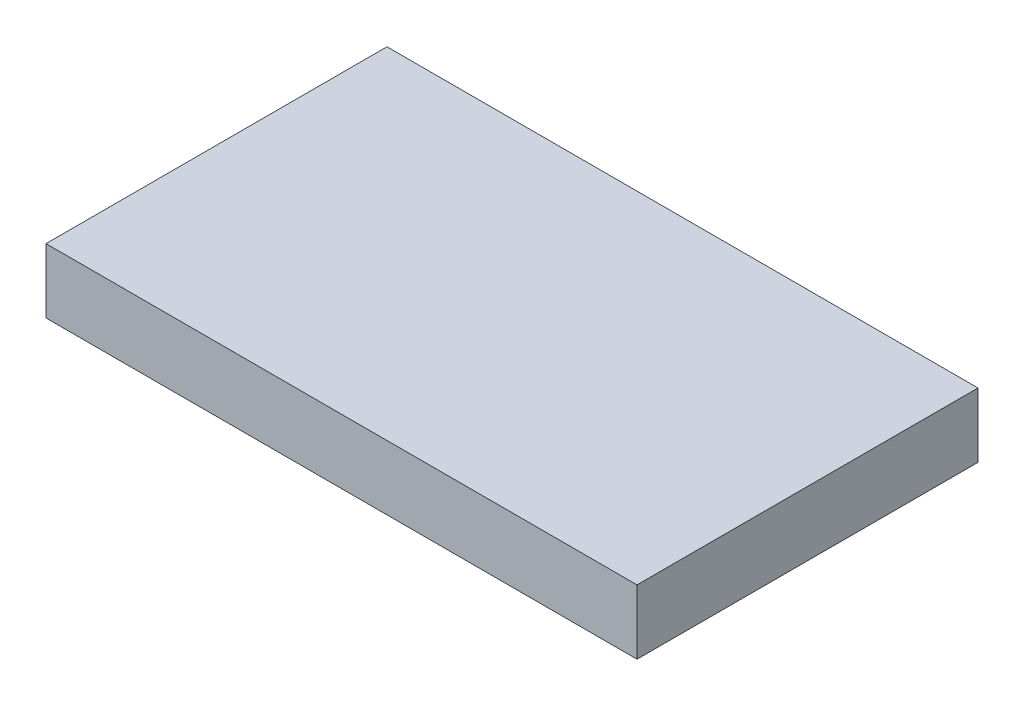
ISO-10303-21;
HEADER;
FILE_DESCRIPTION(('STEP AP214'),'2;1');
FILE_NAME('part.step','',(''),(''),'','','');
FILE_SCHEMA(('AUTOMOTIVE_DESIGN { 1 0 10303 214 1 1 1 1 }'));
ENDSEC;
DATA;
#1=APPLICATION_CONTEXT('core data for automotive mechanical design processes');
#2=APPLICATION_PROTOCOL_DEFINITION('international standard','automotive_design',2000,#1);
#3=PRODUCT_CONTEXT('',#1,'mechanical');
#4=PRODUCT('Part','Part','',(#3));
#5=PRODUCT_RELATED_PRODUCT_CATEGORY('part','',(#4));
#6=PRODUCT_DEFINITION_FORMATION('','',#4);
#7=PRODUCT_DEFINITION_CONTEXT('part definition',#1,'design');
#8=PRODUCT_DEFINITION('design','',#6,#7);
#9=PRODUCT_DEFINITION_SHAPE('','',#8);
#10=(LENGTH_UNIT() NAMED_UNIT(*) SI_UNIT(.MILLI.,.METRE.));
#11=(NAMED_UNIT(*) PLANE_ANGLE_UNIT() SI_UNIT($,.RADIAN.));
#12=(NAMED_UNIT(*) SI_UNIT($,.STERADIAN.) SOLID_ANGLE_UNIT());
#13=UNCERTAINTY_MEASURE_WITH_UNIT(LENGTH_MEASURE(1.E-05),#10,'distance_accuracy_value','');
#14=(GEOMETRIC_REPRESENTATION_CONTEXT(3) GLOBAL_UNCERTAINTY_ASSIGNED_CONTEXT((#13)) GLOBAL_UNIT_ASSIGNED_CONTEXT((#10,
#11,#12)) REPRESENTATION_CONTEXT('',''));
#15=CARTESIAN_POINT('',(0.,0.,0.));
#16=DIRECTION('',(0.,0.,1.));
#17=DIRECTION('',(1.,0.,0.));
#18=AXIS2_PLACEMENT_3D('',#15,#16,#17);
#19=CARTESIAN_POINT('',(78.,17.,45.));
#20=DIRECTION('',(-1.,0.,0.));
#21=DIRECTION('',(0.,0.,1.));
#22=AXIS2_PLACEMENT_3D('',#19,#20,#21);
#23=PLANE('',#22);
#24=DIRECTION('',(0.,0.,-1.));
#25=VECTOR('',#24,1.);
#26=CARTESIAN_POINT('',(78.,0.,45.));
#27=LINE('',#26,#25);
#28=CARTESIAN_POINT('',(78.,0.,45.));
#29=VERTEX_POINT('',#28);
#30=CARTESIAN_POINT('',(78.,0.,-45.));
#31=VERTEX_POINT('',#30);
#32=EDGE_CURVE('E94',#29,#31,#27,.T.);
#33=ORIENTED_EDGE('',*,*,#32,.T.);
#34=DIRECTION('',(0.,-1.,0.));
#35=VECTOR('',#34,1.);
#36=CARTESIAN_POINT('',(78.,17.,-45.));
#37=LINE('',#36,#35);
#38=CARTESIAN_POINT('',(78.,17.,-45.));
#39=VERTEX_POINT('',#38);
#40=EDGE_CURVE('E11',#39,#31,#37,.T.);
#41=ORIENTED_EDGE('',*,*,#40,.F.);
#42=DIRECTION('',(0.,0.,-1.));
#43=VECTOR('',#42,1.);
#44=CARTESIAN_POINT('',(78.,17.,45.));
#45=LINE('',#44,#43);
#46=CARTESIAN_POINT('',(78.,17.,45.));
#47=VERTEX_POINT('',#46);
#48=EDGE_CURVE('E82',#47,#39,#45,.T.);
#49=ORIENTED_EDGE('',*,*,#48,.F.);
#50=DIRECTION('',(0.,-1.,0.));
#51=VECTOR('',#50,1.);
#52=CARTESIAN_POINT('',(78.,17.,45.));
#53=LINE('',#52,#51);
#54=EDGE_CURVE('E90',#47,#29,#53,.T.);
#55=ORIENTED_EDGE('',*,*,#54,.T.);
#56=EDGE_LOOP('',(#33,#41,#49,#55));
#57=FACE_BOUND('',#56,.T.);
#58=ADVANCED_FACE('F31',(#57),#23,.F.);
#59=CARTESIAN_POINT('',(-78.,17.,-45.));
#60=DIRECTION('',(0.,0.,1.));
#61=DIRECTION('',(1.,0.,0.));
#62=AXIS2_PLACEMENT_3D('',#59,#60,#61);
#63=PLANE('',#62);
#64=DIRECTION('',(-1.,0.,0.));
#65=VECTOR('',#64,1.);
#66=CARTESIAN_POINT('',(-78.,0.,-45.));
#67=LINE('',#66,#65);
#68=CARTESIAN_POINT('',(-78.,0.,-45.));
#69=VERTEX_POINT('',#68);
#70=EDGE_CURVE('E86',#31,#69,#67,.T.);
#71=ORIENTED_EDGE('',*,*,#70,.T.);
#72=DIRECTION('',(0.,-1.,0.));
#73=VECTOR('',#72,1.);
#74=CARTESIAN_POINT('',(-78.,17.,-45.));
#75=LINE('',#74,#73);
#76=CARTESIAN_POINT('',(-78.,17.,-45.));
#77=VERTEX_POINT('',#76);
#78=EDGE_CURVE('E39',#77,#69,#75,.T.);
#79=ORIENTED_EDGE('',*,*,#78,.F.);
#80=DIRECTION('',(-1.,0.,0.));
#81=VECTOR('',#80,1.);
#82=CARTESIAN_POINT('',(-78.,17.,-45.));
#83=LINE('',#82,#81);
#84=EDGE_CURVE('E77',#39,#77,#83,.T.);
#85=ORIENTED_EDGE('',*,*,#84,.F.);
#86=ORIENTED_EDGE('',*,*,#40,.T.);
#87=EDGE_LOOP('',(#71,#79,#85,#86));
#88=FACE_BOUND('',#87,.T.);
#89=ADVANCED_FACE('F85',(#88),#63,.F.);
#90=CARTESIAN_POINT('',(-78.,17.,45.));
#91=DIRECTION('',(1.,0.,0.));
#92=DIRECTION('',(0.,0.,-1.));
#93=AXIS2_PLACEMENT_3D('',#90,#91,#92);
#94=PLANE('',#93);
#95=DIRECTION('',(0.,0.,1.));
#96=VECTOR('',#95,1.);
#97=CARTESIAN_POINT('',(-78.,0.,45.));
#98=LINE('',#97,#96);
#99=CARTESIAN_POINT('',(-78.,0.,45.));
#100=VERTEX_POINT('',#99);
#101=EDGE_CURVE('E64',#69,#100,#98,.T.);
#102=ORIENTED_EDGE('',*,*,#101,.T.);
#103=DIRECTION('',(0.,-1.,0.));
#104=VECTOR('',#103,1.);
#105=CARTESIAN_POINT('',(-78.,17.,45.));
#106=LINE('',#105,#104);
#107=CARTESIAN_POINT('',(-78.,17.,45.));
#108=VERTEX_POINT('',#107);
#109=EDGE_CURVE('E87',#108,#100,#106,.T.);
#110=ORIENTED_EDGE('',*,*,#109,.F.);
#111=DIRECTION('',(0.,0.,1.));
#112=VECTOR('',#111,1.);
#113=CARTESIAN_POINT('',(-78.,17.,45.));
#114=LINE('',#113,#112);
#115=EDGE_CURVE('E80',#77,#108,#114,.T.);
#116=ORIENTED_EDGE('',*,*,#115,.F.);
#117=ORIENTED_EDGE('',*,*,#78,.T.);
#118=EDGE_LOOP('',(#102,#110,#116,#117));
#119=FACE_BOUND('',#118,.T.);
#120=ADVANCED_FACE('F88',(#119),#94,.F.);
#121=CARTESIAN_POINT('',(-78.,17.,45.));
#122=DIRECTION('',(0.,0.,-1.));
#123=DIRECTION('',(-1.,0.,0.));
#124=AXIS2_PLACEMENT_3D('',#121,#122,#123);
#125=PLANE('',#124);
#126=DIRECTION('',(1.,0.,0.));
#127=VECTOR('',#126,1.);
#128=CARTESIAN_POINT('',(-78.,0.,45.));
#129=LINE('',#128,#127);
#130=EDGE_CURVE('E70',#100,#29,#129,.T.);
#131=ORIENTED_EDGE('',*,*,#130,.T.);
#132=ORIENTED_EDGE('',*,*,#54,.F.);
#133=DIRECTION('',(1.,0.,0.));
#134=VECTOR('',#133,1.);
#135=CARTESIAN_POINT('',(-78.,17.,45.));
#136=LINE('',#135,#134);
#137=EDGE_CURVE('E47',#108,#47,#136,.T.);
#138=ORIENTED_EDGE('',*,*,#137,.F.);
#139=ORIENTED_EDGE('',*,*,#109,.T.);
#140=EDGE_LOOP('',(#131,#132,#138,#139));
#141=FACE_BOUND('',#140,.T.);
#142=ADVANCED_FACE('F101',(#141),#125,.F.);
#143=CARTESIAN_POINT('',(78.,17.,-45.));
#144=DIRECTION('',(0.,-1.,0.));
#145=DIRECTION('',(0.,0.,-1.));
#146=AXIS2_PLACEMENT_3D('',#143,#144,#145);
#147=PLANE('',#146);
#148=ORIENTED_EDGE('',*,*,#48,.T.);
#149=ORIENTED_EDGE('',*,*,#84,.T.);
#150=ORIENTED_EDGE('',*,*,#115,.T.);
#151=ORIENTED_EDGE('',*,*,#137,.T.);
#152=EDGE_LOOP('',(#148,#149,#150,#151));
#153=FACE_BOUND('',#152,.T.);
#154=ADVANCED_FACE('F78',(#153),#147,.F.);
#155=CARTESIAN_POINT('',(78.,0.,-45.));
#156=DIRECTION('',(0.,-1.,0.));
#157=DIRECTION('',(0.,0.,-1.));
#158=AXIS2_PLACEMENT_3D('',#155,#156,#157);
#159=PLANE('',#158);
#160=ORIENTED_EDGE('',*,*,#32,.F.);
#161=ORIENTED_EDGE('',*,*,#130,.F.);
#162=ORIENTED_EDGE('',*,*,#101,.F.);
#163=ORIENTED_EDGE('',*,*,#70,.F.);
#164=EDGE_LOOP('',(#160,#161,#162,#163));
#165=FACE_BOUND('',#164,.T.);
#166=ADVANCED_FACE('F104',(#165),#159,.T.);
#167=CLOSED_SHELL('',(#58,#89,#120,#142,#154,#166));
#168=MANIFOLD_SOLID_BREP('B2',#167);
#169=ADVANCED_BREP_SHAPE_REPRESENTATION('',(#18,#168),#14);
#170=SHAPE_DEFINITION_REPRESENTATION(#9,#169);
ENDSEC;
END-ISO-10303-21;
